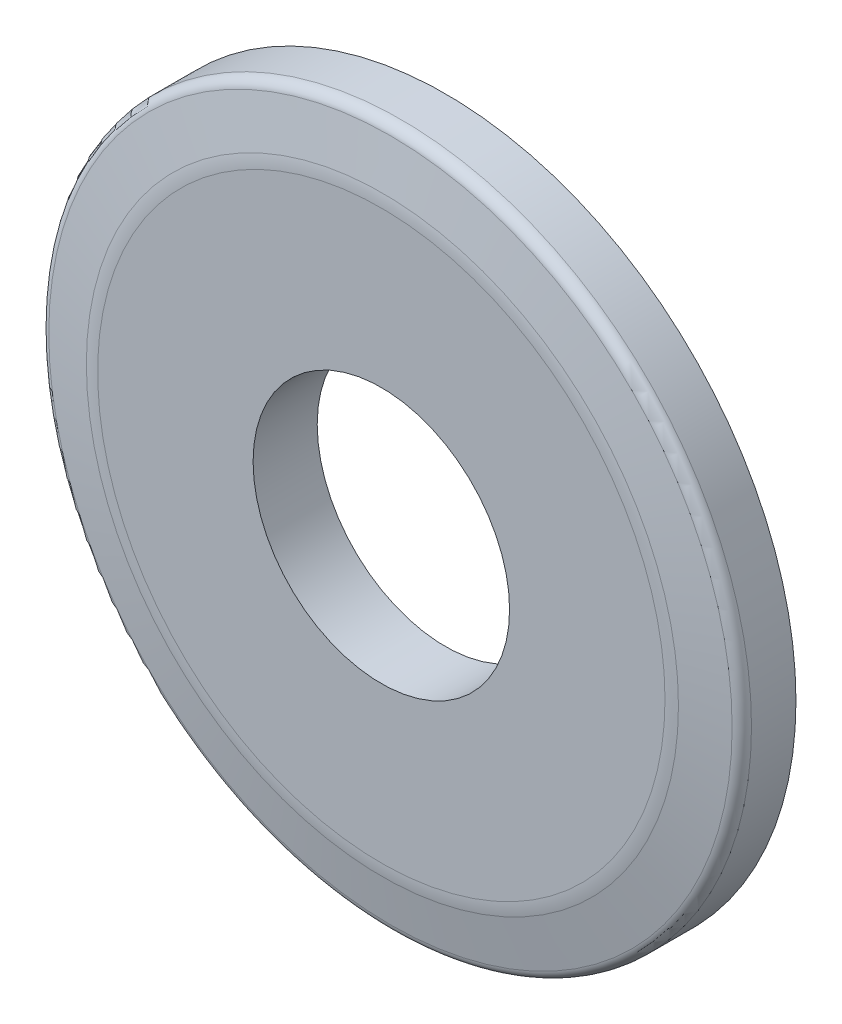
ISO-10303-21;
HEADER;
FILE_DESCRIPTION(('STEP AP214'),'2;1');
FILE_NAME('part.step','',(''),(''),'','','');
FILE_SCHEMA(('AUTOMOTIVE_DESIGN { 1 0 10303 214 1 1 1 1 }'));
ENDSEC;
DATA;
#1=APPLICATION_CONTEXT('core data for automotive mechanical design processes');
#2=APPLICATION_PROTOCOL_DEFINITION('international standard','automotive_design',2000,#1);
#3=PRODUCT_CONTEXT('',#1,'mechanical');
#4=PRODUCT('Part','Part','',(#3));
#5=PRODUCT_RELATED_PRODUCT_CATEGORY('part','',(#4));
#6=PRODUCT_DEFINITION_FORMATION('','',#4);
#7=PRODUCT_DEFINITION_CONTEXT('part definition',#1,'design');
#8=PRODUCT_DEFINITION('design','',#6,#7);
#9=PRODUCT_DEFINITION_SHAPE('','',#8);
#10=(LENGTH_UNIT() NAMED_UNIT(*) SI_UNIT(.MILLI.,.METRE.));
#11=(NAMED_UNIT(*) PLANE_ANGLE_UNIT() SI_UNIT($,.RADIAN.));
#12=(NAMED_UNIT(*) SI_UNIT($,.STERADIAN.) SOLID_ANGLE_UNIT());
#13=UNCERTAINTY_MEASURE_WITH_UNIT(LENGTH_MEASURE(1.E-05),#10,'distance_accuracy_value','');
#14=(GEOMETRIC_REPRESENTATION_CONTEXT(3) GLOBAL_UNCERTAINTY_ASSIGNED_CONTEXT((#13)) GLOBAL_UNIT_ASSIGNED_CONTEXT((#10,
#11,#12)) REPRESENTATION_CONTEXT('',''));
#15=CARTESIAN_POINT('',(0.,0.,0.));
#16=DIRECTION('',(0.,0.,1.));
#17=DIRECTION('',(1.,0.,0.));
#18=AXIS2_PLACEMENT_3D('',#15,#16,#17);
#19=CARTESIAN_POINT('',(0.,0.,4.572));
#20=DIRECTION('',(0.,0.,1.));
#21=DIRECTION('',(1.,0.,0.));
#22=AXIS2_PLACEMENT_3D('',#19,#20,#21);
#23=PLANE('',#22);
#24=CARTESIAN_POINT('',(0.,0.,4.572));
#25=DIRECTION('',(0.,0.,1.));
#26=DIRECTION('',(1.,0.,0.));
#27=AXIS2_PLACEMENT_3D('',#24,#25,#26);
#28=CIRCLE('',#27,20.2276408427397);
#29=CARTESIAN_POINT('',(20.2276408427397,0.,4.572));
#30=VERTEX_POINT('',#29);
#31=EDGE_CURVE('E36',#30,#30,#28,.T.);
#32=ORIENTED_EDGE('',*,*,#31,.T.);
#33=EDGE_LOOP('',(#32));
#34=FACE_BOUND('',#33,.T.);
#35=CARTESIAN_POINT('',(0.,0.,4.572));
#36=DIRECTION('',(0.,0.,1.));
#37=DIRECTION('',(1.,0.,0.));
#38=AXIS2_PLACEMENT_3D('',#35,#36,#37);
#39=CIRCLE('',#38,9.144);
#40=CARTESIAN_POINT('',(9.144,0.,4.572));
#41=VERTEX_POINT('',#40);
#42=EDGE_CURVE('E52',#41,#41,#39,.T.);
#43=ORIENTED_EDGE('',*,*,#42,.F.);
#44=EDGE_LOOP('',(#43));
#45=FACE_BOUND('',#44,.T.);
#46=ADVANCED_FACE('F29',(#34,#45),#23,.T.);
#47=CARTESIAN_POINT('',(0.,0.,0.));
#48=DIRECTION('',(0.,0.,1.));
#49=DIRECTION('',(1.,0.,0.));
#50=AXIS2_PLACEMENT_3D('',#47,#48,#49);
#51=PLANE('',#50);
#52=CARTESIAN_POINT('',(0.,0.,0.));
#53=DIRECTION('',(0.,0.,1.));
#54=DIRECTION('',(1.,0.,0.));
#55=AXIS2_PLACEMENT_3D('',#52,#53,#54);
#56=CIRCLE('',#55,24.9936);
#57=CARTESIAN_POINT('',(24.9936,0.,0.));
#58=VERTEX_POINT('',#57);
#59=EDGE_CURVE('E49',#58,#58,#56,.T.);
#60=ORIENTED_EDGE('',*,*,#59,.F.);
#61=EDGE_LOOP('',(#60));
#62=FACE_BOUND('',#61,.T.);
#63=CARTESIAN_POINT('',(0.,0.,0.));
#64=DIRECTION('',(0.,0.,1.));
#65=DIRECTION('',(1.,0.,0.));
#66=AXIS2_PLACEMENT_3D('',#63,#64,#65);
#67=CIRCLE('',#66,9.144);
#68=CARTESIAN_POINT('',(9.144,0.,0.));
#69=VERTEX_POINT('',#68);
#70=EDGE_CURVE('E55',#69,#69,#67,.T.);
#71=ORIENTED_EDGE('',*,*,#70,.T.);
#72=EDGE_LOOP('',(#71));
#73=FACE_BOUND('',#72,.T.);
#74=ADVANCED_FACE('F59',(#62,#73),#51,.F.);
#75=CARTESIAN_POINT('',(0.,0.,4.572));
#76=DIRECTION('',(0.,0.,-1.));
#77=DIRECTION('',(-1.,0.,0.));
#78=AXIS2_PLACEMENT_3D('',#75,#76,#77);
#79=CYLINDRICAL_SURFACE('',#78,24.9936);
#80=CARTESIAN_POINT('',(0.,0.,3.17060608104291));
#81=DIRECTION('',(0.,0.,1.));
#82=DIRECTION('',(1.,0.,0.));
#83=AXIS2_PLACEMENT_3D('',#80,#81,#82);
#84=CIRCLE('',#83,24.9936);
#85=CARTESIAN_POINT('',(24.9936,0.,3.17060608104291));
#86=VERTEX_POINT('',#85);
#87=EDGE_CURVE('E44',#86,#86,#84,.F.);
#88=ORIENTED_EDGE('',*,*,#87,.T.);
#89=EDGE_LOOP('',(#88));
#90=FACE_BOUND('',#89,.T.);
#91=ORIENTED_EDGE('',*,*,#59,.T.);
#92=EDGE_LOOP('',(#91));
#93=FACE_BOUND('',#92,.T.);
#94=ADVANCED_FACE('F31',(#90,#93),#79,.T.);
#95=CARTESIAN_POINT('',(0.,0.,4.572));
#96=DIRECTION('',(0.,0.,-1.));
#97=DIRECTION('',(-1.,0.,0.));
#98=AXIS2_PLACEMENT_3D('',#95,#96,#97);
#99=CYLINDRICAL_SURFACE('',#98,9.144);
#100=ORIENTED_EDGE('',*,*,#42,.T.);
#101=EDGE_LOOP('',(#100));
#102=FACE_BOUND('',#101,.T.);
#103=ORIENTED_EDGE('',*,*,#70,.F.);
#104=EDGE_LOOP('',(#103));
#105=FACE_BOUND('',#104,.T.);
#106=ADVANCED_FACE('F61',(#102,#105),#99,.F.);
#107=CARTESIAN_POINT('',(0.,0.,4.572));
#108=DIRECTION('',(0.,0.,-1.));
#109=DIRECTION('',(-1.,0.,0.));
#110=AXIS2_PLACEMENT_3D('',#107,#108,#109);
#111=CONICAL_SURFACE('',#110,20.6720832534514,1.39626340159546);
#112=CARTESIAN_POINT('',(0.,0.,4.49482338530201));
#113=DIRECTION('',(0.,0.,1.));
#114=DIRECTION('',(1.,0.,0.));
#115=AXIS2_PLACEMENT_3D('',#112,#113,#114);
#116=CIRCLE('',#115,21.1097735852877);
#117=CARTESIAN_POINT('',(21.1097735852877,0.,4.49482338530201));
#118=VERTEX_POINT('',#117);
#119=EDGE_CURVE('E10',#118,#118,#116,.F.);
#120=ORIENTED_EDGE('',*,*,#119,.T.);
#121=EDGE_LOOP('',(#120));
#122=FACE_BOUND('',#121,.T.);
#123=CARTESIAN_POINT('',(0.,0.,3.92102958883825));
#124=DIRECTION('',(0.,0.,-1.));
#125=DIRECTION('',(-1.,0.,0.));
#126=AXIS2_PLACEMENT_3D('',#123,#124,#125);
#127=CIRCLE('',#126,24.3639199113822);
#128=CARTESIAN_POINT('',(-24.3639199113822,0.,3.92102958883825));
#129=VERTEX_POINT('',#128);
#130=EDGE_CURVE('E40',#129,#129,#127,.F.);
#131=ORIENTED_EDGE('',*,*,#130,.T.);
#132=EDGE_LOOP('',(#131));
#133=FACE_BOUND('',#132,.T.);
#134=ADVANCED_FACE('F63',(#122,#133),#111,.T.);
#135=CARTESIAN_POINT('',(0.,0.,3.17060608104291));
#136=DIRECTION('',(0.,0.,1.));
#137=DIRECTION('',(1.,0.,0.));
#138=AXIS2_PLACEMENT_3D('',#135,#136,#137);
#139=TOROIDAL_SURFACE('',#138,24.2316,0.762);
#140=ORIENTED_EDGE('',*,*,#130,.F.);
#141=EDGE_LOOP('',(#140));
#142=FACE_BOUND('',#141,.T.);
#143=ORIENTED_EDGE('',*,*,#87,.F.);
#144=EDGE_LOOP('',(#143));
#145=FACE_BOUND('',#144,.T.);
#146=ADVANCED_FACE('F70',(#142,#145),#139,.T.);
#147=CARTESIAN_POINT('',(0.,0.,-0.508000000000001));
#148=DIRECTION('',(0.,0.,1.));
#149=DIRECTION('',(1.,0.,0.));
#150=AXIS2_PLACEMENT_3D('',#147,#148,#149);
#151=TOROIDAL_SURFACE('',#150,20.2276408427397,5.08);
#152=ORIENTED_EDGE('',*,*,#119,.F.);
#153=EDGE_LOOP('',(#152));
#154=FACE_BOUND('',#153,.T.);
#155=ORIENTED_EDGE('',*,*,#31,.F.);
#156=EDGE_LOOP('',(#155));
#157=FACE_BOUND('',#156,.T.);
#158=ADVANCED_FACE('F99',(#154,#157),#151,.T.);
#159=CLOSED_SHELL('',(#46,#74,#94,#106,#134,#146,#158));
#160=MANIFOLD_SOLID_BREP('B2',#159);
#161=ADVANCED_BREP_SHAPE_REPRESENTATION('',(#18,#160),#14);
#162=SHAPE_DEFINITION_REPRESENTATION(#9,#161);
ENDSEC;
END-ISO-10303-21;
